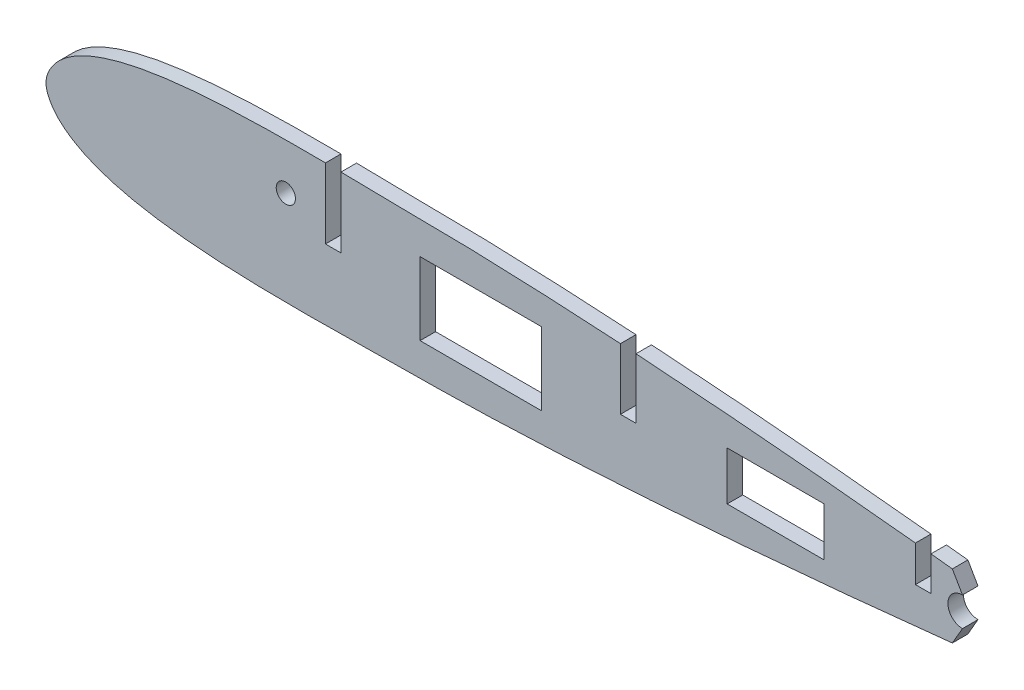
ISO-10303-21;
HEADER;
FILE_DESCRIPTION(('STEP AP214'),'2;1');
FILE_NAME('part.step','',(''),(''),'','','');
FILE_SCHEMA(('AUTOMOTIVE_DESIGN { 1 0 10303 214 1 1 1 1 }'));
ENDSEC;
DATA;
#1=APPLICATION_CONTEXT('core data for automotive mechanical design processes');
#2=APPLICATION_PROTOCOL_DEFINITION('international standard','automotive_design',2000,#1);
#3=PRODUCT_CONTEXT('',#1,'mechanical');
#4=PRODUCT('Part','Part','',(#3));
#5=PRODUCT_RELATED_PRODUCT_CATEGORY('part','',(#4));
#6=PRODUCT_DEFINITION_FORMATION('','',#4);
#7=PRODUCT_DEFINITION_CONTEXT('part definition',#1,'design');
#8=PRODUCT_DEFINITION('design','',#6,#7);
#9=PRODUCT_DEFINITION_SHAPE('','',#8);
#10=(LENGTH_UNIT() NAMED_UNIT(*) SI_UNIT(.MILLI.,.METRE.));
#11=(NAMED_UNIT(*) PLANE_ANGLE_UNIT() SI_UNIT($,.RADIAN.));
#12=(NAMED_UNIT(*) SI_UNIT($,.STERADIAN.) SOLID_ANGLE_UNIT());
#13=UNCERTAINTY_MEASURE_WITH_UNIT(LENGTH_MEASURE(1.E-05),#10,'distance_accuracy_value','');
#14=(GEOMETRIC_REPRESENTATION_CONTEXT(3) GLOBAL_UNCERTAINTY_ASSIGNED_CONTEXT((#13)) GLOBAL_UNIT_ASSIGNED_CONTEXT((#10,
#11,#12)) REPRESENTATION_CONTEXT('',''));
#15=CARTESIAN_POINT('',(0.,0.,0.));
#16=DIRECTION('',(0.,0.,1.));
#17=DIRECTION('',(1.,0.,0.));
#18=AXIS2_PLACEMENT_3D('',#15,#16,#17);
#19=CARTESIAN_POINT('',(73.1109777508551,2.76717396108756,-3.2));
#20=DIRECTION('',(0.,0.,-1.));
#21=DIRECTION('',(1.,0.,0.));
#22=AXIS2_PLACEMENT_3D('',#19,#20,#21);
#23=PLANE('',#22);
#24=DIRECTION('',(1.,0.,0.));
#25=VECTOR('',#24,1.);
#26=CARTESIAN_POINT('',(-60.9374477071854,-8.53281098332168,-3.2));
#27=LINE('',#26,#25);
#28=CARTESIAN_POINT('',(-60.9374477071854,-8.53281098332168,-3.2));
#29=VERTEX_POINT('',#28);
#30=CARTESIAN_POINT('',(-35.9374477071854,-8.53281098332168,-3.2));
#31=VERTEX_POINT('',#30);
#32=EDGE_CURVE('E310',#29,#31,#27,.T.);
#33=ORIENTED_EDGE('',*,*,#32,.T.);
#34=DIRECTION('',(0.,1.,0.));
#35=VECTOR('',#34,1.);
#36=CARTESIAN_POINT('',(-35.9374477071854,6.46718901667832,-3.2));
#37=LINE('',#36,#35);
#38=CARTESIAN_POINT('',(-35.9374477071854,6.46718901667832,-3.2));
#39=VERTEX_POINT('',#38);
#40=EDGE_CURVE('E315',#31,#39,#37,.T.);
#41=ORIENTED_EDGE('',*,*,#40,.T.);
#42=DIRECTION('',(-1.,0.,0.));
#43=VECTOR('',#42,1.);
#44=CARTESIAN_POINT('',(-60.9374477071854,6.46718901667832,-3.2));
#45=LINE('',#44,#43);
#46=CARTESIAN_POINT('',(-60.9374477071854,6.46718901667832,-3.2));
#47=VERTEX_POINT('',#46);
#48=EDGE_CURVE('E319',#39,#47,#45,.T.);
#49=ORIENTED_EDGE('',*,*,#48,.T.);
#50=DIRECTION('',(0.,-1.,0.));
#51=VECTOR('',#50,1.);
#52=CARTESIAN_POINT('',(-60.9374477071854,6.46718901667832,-3.2));
#53=LINE('',#52,#51);
#54=EDGE_CURVE('E306',#47,#29,#53,.T.);
#55=ORIENTED_EDGE('',*,*,#54,.T.);
#56=EDGE_LOOP('',(#33,#41,#49,#55));
#57=FACE_BOUND('',#56,.T.);
#58=DIRECTION('',(1.,0.,0.));
#59=VECTOR('',#58,1.);
#60=CARTESIAN_POINT('',(2.36255229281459,-6.03281098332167,-3.2));
#61=LINE('',#60,#59);
#62=CARTESIAN_POINT('',(2.36255229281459,-6.03281098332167,-3.2));
#63=VERTEX_POINT('',#62);
#64=CARTESIAN_POINT('',(22.3625522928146,-6.03281098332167,-3.2));
#65=VERTEX_POINT('',#64);
#66=EDGE_CURVE('E265',#63,#65,#61,.T.);
#67=ORIENTED_EDGE('',*,*,#66,.T.);
#68=DIRECTION('',(0.,1.,0.));
#69=VECTOR('',#68,1.);
#70=CARTESIAN_POINT('',(22.3625522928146,-6.03281098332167,-3.2));
#71=LINE('',#70,#69);
#72=CARTESIAN_POINT('',(22.3625522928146,3.96718901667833,-3.2));
#73=VERTEX_POINT('',#72);
#74=EDGE_CURVE('E270',#65,#73,#71,.T.);
#75=ORIENTED_EDGE('',*,*,#74,.T.);
#76=DIRECTION('',(-1.,0.,0.));
#77=VECTOR('',#76,1.);
#78=CARTESIAN_POINT('',(2.36255229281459,3.96718901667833,-3.2));
#79=LINE('',#78,#77);
#80=CARTESIAN_POINT('',(2.36255229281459,3.96718901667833,-3.2));
#81=VERTEX_POINT('',#80);
#82=EDGE_CURVE('E274',#73,#81,#79,.T.);
#83=ORIENTED_EDGE('',*,*,#82,.T.);
#84=DIRECTION('',(0.,-1.,0.));
#85=VECTOR('',#84,1.);
#86=CARTESIAN_POINT('',(2.36255229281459,-6.03281098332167,-3.2));
#87=LINE('',#86,#85);
#88=EDGE_CURVE('E261',#81,#63,#87,.T.);
#89=ORIENTED_EDGE('',*,*,#88,.T.);
#90=EDGE_LOOP('',(#67,#75,#83,#89));
#91=FACE_BOUND('',#90,.T.);
#92=CARTESIAN_POINT('',(50.8625522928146,-1.03281098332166,-3.2));
#93=DIRECTION('',(0.,0.,1.));
#94=DIRECTION('',(1.,0.,0.));
#95=AXIS2_PLACEMENT_3D('',#92,#93,#94);
#96=CIRCLE('',#95,3.);
#97=CARTESIAN_POINT('',(50.8625522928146,-4.03281098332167,-3.2));
#98=VERTEX_POINT('',#97);
#99=CARTESIAN_POINT('',(50.8625522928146,1.96718901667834,-3.2));
#100=VERTEX_POINT('',#99);
#101=EDGE_CURVE('E240',#98,#100,#96,.F.);
#102=ORIENTED_EDGE('',*,*,#101,.F.);
#103=DIRECTION('',(-0.499999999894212,-0.866025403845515,0.));
#104=VECTOR('',#103,1.);
#105=CARTESIAN_POINT('',(59.3691385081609,10.7010285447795,-3.2));
#106=LINE('',#105,#104);
#107=CARTESIAN_POINT('',(48.7727036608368,-7.65253499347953,-3.2017127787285));
#108=VERTEX_POINT('',#107);
#109=EDGE_CURVE('E213',#98,#108,#106,.T.);
#110=ORIENTED_EDGE('',*,*,#109,.T.);
#111=CARTESIAN_POINT('',(-80.4374477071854,13.4443350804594,-3.2));
#112=CARTESIAN_POINT('',(-81.8006706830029,13.4554971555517,-3.2));
#113=CARTESIAN_POINT('',(-85.1458243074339,13.4734032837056,-3.2));
#114=CARTESIAN_POINT('',(-90.4734834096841,13.4495670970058,-3.2));
#115=CARTESIAN_POINT('',(-96.4205625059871,13.3258606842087,-3.2));
#116=CARTESIAN_POINT('',(-102.369294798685,13.0744103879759,-3.2));
#117=CARTESIAN_POINT('',(-108.320662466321,12.6450852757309,-3.2));
#118=CARTESIAN_POINT('',(-113.878040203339,12.026122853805,-3.2));
#119=CARTESIAN_POINT('',(-119.041165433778,11.1792430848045,-3.2));
#120=CARTESIAN_POINT('',(-123.008119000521,10.276240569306,-3.2));
#121=CARTESIAN_POINT('',(-126.169709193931,9.32018202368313,-3.2));
#122=CARTESIAN_POINT('',(-128.562640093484,8.44544898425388,-3.2));
#123=CARTESIAN_POINT('',(-130.96962167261,7.3486093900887,-3.2));
#124=CARTESIAN_POINT('',(-133.419212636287,5.91146885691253,-3.2));
#125=CARTESIAN_POINT('',(-135.451185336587,4.23077972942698,-3.2));
#126=CARTESIAN_POINT('',(-137.240728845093,1.98115305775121,-3.2));
#127=CARTESIAN_POINT('',(-138.557845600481,-1.04571684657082,-3.2));
#128=CARTESIAN_POINT('',(-137.240403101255,-4.07244498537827,-3.2));
#129=CARTESIAN_POINT('',(-135.450617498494,-6.3218790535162,-3.2));
#130=CARTESIAN_POINT('',(-133.41846393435,-8.00234949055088,-3.2));
#131=CARTESIAN_POINT('',(-130.968718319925,-9.43922639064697,-3.2));
#132=CARTESIAN_POINT('',(-128.56161871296,-10.5358069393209,-3.2));
#133=CARTESIAN_POINT('',(-126.168593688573,-11.4102824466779,-3.2));
#134=CARTESIAN_POINT('',(-123.006900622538,-12.366000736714,-3.2));
#135=CARTESIAN_POINT('',(-119.039849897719,-13.2685763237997,-3.2));
#136=CARTESIAN_POINT('',(-113.876633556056,-14.1149004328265,-3.2));
#137=CARTESIAN_POINT('',(-108.319189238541,-14.7332647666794,-3.2));
#138=CARTESIAN_POINT('',(-102.36777540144,-15.161949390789,-3.2));
#139=CARTESIAN_POINT('',(-96.4190160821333,-15.4127594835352,-3.2));
#140=CARTESIAN_POINT('',(-90.4719237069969,-15.5358258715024,-3.2));
#141=CARTESIAN_POINT('',(-84.5255792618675,-15.5617901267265,-3.2));
#142=CARTESIAN_POINT('',(-78.5797220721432,-15.518516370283,-3.2));
#143=CARTESIAN_POINT('',(-72.7132535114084,-15.4365106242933,-3.2));
#144=CARTESIAN_POINT('',(-64.8661756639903,-15.2533469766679,-3.2));
#145=CARTESIAN_POINT('',(-55.0326455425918,-15.2595190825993,-3.2));
#146=CARTESIAN_POINT('',(-43.1405398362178,-14.8754543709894,-3.2));
#147=CARTESIAN_POINT('',(-31.1689328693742,-14.3558874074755,-3.2));
#148=CARTESIAN_POINT('',(-19.1986067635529,-13.6543817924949,-3.2));
#149=CARTESIAN_POINT('',(-7.22792859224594,-12.8347407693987,-3.2));
#150=CARTESIAN_POINT('',(4.66318857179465,-11.9053327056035,-3.2));
#151=CARTESIAN_POINT('',(16.5547312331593,-10.8822738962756,-3.2));
#152=CARTESIAN_POINT('',(28.4458294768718,-9.76389533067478,-3.2));
#153=CARTESIAN_POINT('',(39.1855199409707,-8.68024311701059,-3.2));
#154=CARTESIAN_POINT('',(45.9601822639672,-7.95856970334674,-3.2));
#155=CARTESIAN_POINT('',(48.7726808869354,-7.65250874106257,-3.2));
#156=B_SPLINE_CURVE_WITH_KNOTS('',3,(#111,#112,#113,#114,#115,#116,#117,#118,#119,#120,#121,
#122,#123,#124,#125,#126,#127,#128,#129,#130,#131,#132,#133,#134,#135,#136,#137,#138,#139,#140,
#141,#142,#143,#144,#145,#146,#147,#148,#149,#150,#151,#152,#153,#154,#155),.UNSPECIFIED.,.F.,
.F.,(4,1,1,1,1,1,1,1,1,1,1,1,1,1,1,1,1,1,1,1,1,1,1,1,1,1,1,1,1,1,1,1,1,1,1,1,1,1,1,1,1,1,4),
(0.371375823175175,0.379770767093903,0.391975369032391,0.404182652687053,0.416398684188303,
0.428636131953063,0.440920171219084,0.450818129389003,0.460843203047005,0.465945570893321,
0.471149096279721,0.476522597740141,0.482208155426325,0.488618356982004,0.492567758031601,0.5,
0.507432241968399,0.511381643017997,0.517791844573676,0.523477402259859,0.528850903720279,
0.534054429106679,0.539156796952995,0.549181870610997,0.559079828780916,0.571363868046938,
0.583601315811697,0.595817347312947,0.608024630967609,0.620229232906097,0.632433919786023,
0.644639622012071,0.656358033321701,0.680768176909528,0.70518703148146,0.729619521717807,
0.754557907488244,0.779023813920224,0.803506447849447,0.828005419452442,0.852521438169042,
0.87705400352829,0.89447551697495),.UNSPECIFIED.);
#157=CARTESIAN_POINT('',(-80.4374477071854,13.4443350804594,-3.2));
#158=VERTEX_POINT('',#157);
#159=EDGE_CURVE('E225',#158,#108,#156,.T.);
#160=ORIENTED_EDGE('',*,*,#159,.F.);
#161=DIRECTION('',(0.,1.,0.));
#162=VECTOR('',#161,1.);
#163=CARTESIAN_POINT('',(-80.4374477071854,-1.03281098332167,-3.2));
#164=LINE('',#163,#162);
#165=CARTESIAN_POINT('',(-80.4374477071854,-1.03281098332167,-3.2));
#166=VERTEX_POINT('',#165);
#167=EDGE_CURVE('E234',#166,#158,#164,.T.);
#168=ORIENTED_EDGE('',*,*,#167,.F.);
#169=DIRECTION('',(-1.,0.,0.));
#170=VECTOR('',#169,1.);
#171=CARTESIAN_POINT('',(-80.4374477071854,-1.03281098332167,-3.2));
#172=LINE('',#171,#170);
#173=CARTESIAN_POINT('',(-77.2374477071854,-1.03281098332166,-3.2));
#174=VERTEX_POINT('',#173);
#175=EDGE_CURVE('E564',#174,#166,#172,.T.);
#176=ORIENTED_EDGE('',*,*,#175,.F.);
#177=DIRECTION('',(0.,-1.,0.));
#178=VECTOR('',#177,1.);
#179=CARTESIAN_POINT('',(-77.2374477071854,-1.03281098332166,-3.2));
#180=LINE('',#179,#178);
#181=CARTESIAN_POINT('',(-77.2374477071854,13.4117089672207,-3.2));
#182=VERTEX_POINT('',#181);
#183=EDGE_CURVE('E600',#182,#174,#180,.T.);
#184=ORIENTED_EDGE('',*,*,#183,.F.);
#185=CARTESIAN_POINT('',(-19.6374477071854,11.5837049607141,-3.2));
#186=CARTESIAN_POINT('',(-23.5083202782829,11.827758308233,-3.2));
#187=CARTESIAN_POINT('',(-31.3414661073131,12.2834181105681,-3.2));
#188=CARTESIAN_POINT('',(-43.1420287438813,12.7942893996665,-3.2));
#189=CARTESIAN_POINT('',(-55.0341757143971,13.1770742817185,-3.2));
#190=CARTESIAN_POINT('',(-64.8677051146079,13.1698438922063,-3.2));
#191=CARTESIAN_POINT('',(-72.2668637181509,13.3417556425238,-3.2));
#192=CARTESIAN_POINT('',(-75.703508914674,13.3931359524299,-3.2));
#193=CARTESIAN_POINT('',(-77.2374477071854,13.4117089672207,-3.2));
#194=B_SPLINE_CURVE_WITH_KNOTS('',3,(#185,#186,#187,#188,#189,#190,#191,#192,#193),
.UNSPECIFIED.,.F.,.F.,(4,1,1,1,1,1,4),(0.246496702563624,0.270380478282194,0.29481296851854,
0.319231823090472,0.343641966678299,0.355360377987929,0.364806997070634),.UNSPECIFIED.);
#195=CARTESIAN_POINT('',(-19.6374477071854,11.5837049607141,-3.2));
#196=VERTEX_POINT('',#195);
#197=EDGE_CURVE('E607',#196,#182,#194,.T.);
#198=ORIENTED_EDGE('',*,*,#197,.F.);
#199=DIRECTION('',(0.,1.,0.));
#200=VECTOR('',#199,1.);
#201=CARTESIAN_POINT('',(-19.6374477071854,-1.03281098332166,-3.2));
#202=LINE('',#201,#200);
#203=CARTESIAN_POINT('',(-19.6374477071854,-1.03281098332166,-3.2));
#204=VERTEX_POINT('',#203);
#205=EDGE_CURVE('E614',#204,#196,#202,.T.);
#206=ORIENTED_EDGE('',*,*,#205,.F.);
#207=DIRECTION('',(-1.,0.,0.));
#208=VECTOR('',#207,1.);
#209=CARTESIAN_POINT('',(-19.6374477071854,-1.03281098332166,-3.2));
#210=LINE('',#209,#208);
#211=CARTESIAN_POINT('',(-16.4374477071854,-1.03281098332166,-3.2));
#212=VERTEX_POINT('',#211);
#213=EDGE_CURVE('E651',#212,#204,#210,.T.);
#214=ORIENTED_EDGE('',*,*,#213,.F.);
#215=DIRECTION('',(0.,-1.,0.));
#216=VECTOR('',#215,1.);
#217=CARTESIAN_POINT('',(-16.4374477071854,-1.03281098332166,-3.2));
#218=LINE('',#217,#216);
#219=CARTESIAN_POINT('',(-16.4374477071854,11.3777301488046,-3.2));
#220=VERTEX_POINT('',#219);
#221=EDGE_CURVE('E372',#220,#212,#218,.T.);
#222=ORIENTED_EDGE('',*,*,#221,.F.);
#223=CARTESIAN_POINT('',(41.1625522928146,6.39263718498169,-3.2));
#224=CARTESIAN_POINT('',(40.8858120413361,6.42156748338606,-3.2));
#225=CARTESIAN_POINT('',(36.6466893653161,6.86375130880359,-3.2));
#226=CARTESIAN_POINT('',(28.444890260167,7.69043450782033,-3.2));
#227=CARTESIAN_POINT('',(16.5536717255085,8.8075333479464,-3.2));
#228=CARTESIAN_POINT('',(4.66201903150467,9.82931238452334,-3.2));
#229=CARTESIAN_POINT('',(-6.33430215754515,10.6875926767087,-3.2));
#230=CARTESIAN_POINT('',(-13.3686011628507,11.1761671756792,-3.2));
#231=CARTESIAN_POINT('',(-16.4374477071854,11.3777301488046,-3.2));
#232=B_SPLINE_CURVE_WITH_KNOTS('',3,(#223,#224,#225,#226,#227,#228,#229,#230,#231),
.UNSPECIFIED.,.F.,.F.,(4,1,1,1,1,1,4),(0.121232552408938,0.12294599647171,0.147478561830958,
0.171994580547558,0.196493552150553,0.220976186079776,0.239914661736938),.UNSPECIFIED.);
#233=CARTESIAN_POINT('',(41.1625522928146,6.39263718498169,-3.2));
#234=VERTEX_POINT('',#233);
#235=EDGE_CURVE('E365',#234,#220,#232,.T.);
#236=ORIENTED_EDGE('',*,*,#235,.F.);
#237=DIRECTION('',(0.,1.,0.));
#238=VECTOR('',#237,1.);
#239=CARTESIAN_POINT('',(41.1625522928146,-1.03281098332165,-3.2));
#240=LINE('',#239,#238);
#241=CARTESIAN_POINT('',(41.1625522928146,-1.03281098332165,-3.2));
#242=VERTEX_POINT('',#241);
#243=EDGE_CURVE('E360',#242,#234,#240,.T.);
#244=ORIENTED_EDGE('',*,*,#243,.F.);
#245=DIRECTION('',(-1.,0.,0.));
#246=VECTOR('',#245,1.);
#247=CARTESIAN_POINT('',(41.1625522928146,-1.03281098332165,-3.2));
#248=LINE('',#247,#246);
#249=CARTESIAN_POINT('',(44.3625522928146,-1.03281098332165,-3.2));
#250=VERTEX_POINT('',#249);
#251=EDGE_CURVE('E353',#250,#242,#248,.T.);
#252=ORIENTED_EDGE('',*,*,#251,.F.);
#253=DIRECTION('',(0.,-1.,0.));
#254=VECTOR('',#253,1.);
#255=CARTESIAN_POINT('',(44.3625522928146,-1.03281098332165,-3.2));
#256=LINE('',#255,#254);
#257=CARTESIAN_POINT('',(44.3625522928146,6.05528791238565,-3.2));
#258=VERTEX_POINT('',#257);
#259=EDGE_CURVE('E361',#258,#250,#256,.T.);
#260=ORIENTED_EDGE('',*,*,#259,.F.);
#261=CARTESIAN_POINT('',(48.7762257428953,5.58077271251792,-3.2));
#262=CARTESIAN_POINT('',(47.3051899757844,5.74069659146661,-3.2));
#263=CARTESIAN_POINT('',(45.8339647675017,5.89887388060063,-3.2));
#264=CARTESIAN_POINT('',(44.3625522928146,6.05528791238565,-3.2));
#265=B_SPLINE_CURVE_WITH_KNOTS('',3,(#261,#262,#263,#264),.UNSPECIFIED.,.F.,.F.,(4,4),
(0.105515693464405,0.114627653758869),.UNSPECIFIED.);
#266=CARTESIAN_POINT('',(48.7762275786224,5.58080940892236,-3.2));
#267=VERTEX_POINT('',#266);
#268=EDGE_CURVE('E436',#267,#258,#265,.T.);
#269=ORIENTED_EDGE('',*,*,#268,.F.);
#270=DIRECTION('',(-0.500000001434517,0.86602540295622,0.));
#271=VECTOR('',#270,1.);
#272=CARTESIAN_POINT('',(56.0782550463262,-7.06667311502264,-3.2));
#273=LINE('',#272,#271);
#274=EDGE_CURVE('E248',#100,#267,#273,.T.);
#275=ORIENTED_EDGE('',*,*,#274,.F.);
#276=EDGE_LOOP('',(#102,#110,#160,#168,#176,#184,#198,#206,#214,#222,#236,#244,#252,#260,#269,#275));
#277=FACE_BOUND('',#276,.T.);
#278=CARTESIAN_POINT('',(-88.6046583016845,3.96718901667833,-3.2));
#279=DIRECTION('',(0.,0.,-1.));
#280=DIRECTION('',(-1.,0.,0.));
#281=AXIS2_PLACEMENT_3D('',#278,#279,#280);
#282=CIRCLE('',#281,1.9812);
#283=CARTESIAN_POINT('',(-90.5858583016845,3.96718901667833,-3.2));
#284=VERTEX_POINT('',#283);
#285=EDGE_CURVE('E222',#284,#284,#282,.F.);
#286=ORIENTED_EDGE('',*,*,#285,.T.);
#287=EDGE_LOOP('',(#286));
#288=FACE_BOUND('',#287,.T.);
#289=ADVANCED_FACE('F49',(#57,#91,#277,#288),#23,.T.);
#290=CARTESIAN_POINT('',(73.1109777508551,2.76717396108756,0.));
#291=DIRECTION('',(0.,0.,-1.));
#292=DIRECTION('',(1.,0.,0.));
#293=AXIS2_PLACEMENT_3D('',#290,#291,#292);
#294=PLANE('',#293);
#295=DIRECTION('',(0.,-1.,0.));
#296=VECTOR('',#295,1.);
#297=CARTESIAN_POINT('',(2.36255229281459,-6.03281098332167,0.));
#298=LINE('',#297,#296);
#299=CARTESIAN_POINT('',(2.3625522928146,3.96718901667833,0.));
#300=VERTEX_POINT('',#299);
#301=CARTESIAN_POINT('',(2.36255229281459,-6.03281098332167,0.));
#302=VERTEX_POINT('',#301);
#303=EDGE_CURVE('E279',#300,#302,#298,.T.);
#304=ORIENTED_EDGE('',*,*,#303,.F.);
#305=DIRECTION('',(-1.,0.,0.));
#306=VECTOR('',#305,1.);
#307=CARTESIAN_POINT('',(2.36255229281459,3.96718901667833,0.));
#308=LINE('',#307,#306);
#309=CARTESIAN_POINT('',(22.3625522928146,3.96718901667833,0.));
#310=VERTEX_POINT('',#309);
#311=EDGE_CURVE('E266',#310,#300,#308,.T.);
#312=ORIENTED_EDGE('',*,*,#311,.F.);
#313=DIRECTION('',(0.,1.,0.));
#314=VECTOR('',#313,1.);
#315=CARTESIAN_POINT('',(22.3625522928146,-6.03281098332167,0.));
#316=LINE('',#315,#314);
#317=CARTESIAN_POINT('',(22.3625522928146,-6.03281098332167,0.));
#318=VERTEX_POINT('',#317);
#319=EDGE_CURVE('E287',#318,#310,#316,.T.);
#320=ORIENTED_EDGE('',*,*,#319,.F.);
#321=DIRECTION('',(1.,0.,0.));
#322=VECTOR('',#321,1.);
#323=CARTESIAN_POINT('',(2.36255229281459,-6.03281098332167,0.));
#324=LINE('',#323,#322);
#325=EDGE_CURVE('E283',#302,#318,#324,.T.);
#326=ORIENTED_EDGE('',*,*,#325,.F.);
#327=EDGE_LOOP('',(#304,#312,#320,#326));
#328=FACE_BOUND('',#327,.T.);
#329=DIRECTION('',(0.,-1.,0.));
#330=VECTOR('',#329,1.);
#331=CARTESIAN_POINT('',(-60.9374477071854,6.46718901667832,0.));
#332=LINE('',#331,#330);
#333=CARTESIAN_POINT('',(-60.9374477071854,6.46718901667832,0.));
#334=VERTEX_POINT('',#333);
#335=CARTESIAN_POINT('',(-60.9374477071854,-8.53281098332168,0.));
#336=VERTEX_POINT('',#335);
#337=EDGE_CURVE('E305',#334,#336,#332,.T.);
#338=ORIENTED_EDGE('',*,*,#337,.F.);
#339=DIRECTION('',(-1.,0.,0.));
#340=VECTOR('',#339,1.);
#341=CARTESIAN_POINT('',(-60.9374477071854,6.46718901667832,0.));
#342=LINE('',#341,#340);
#343=CARTESIAN_POINT('',(-35.9374477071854,6.46718901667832,0.));
#344=VERTEX_POINT('',#343);
#345=EDGE_CURVE('E311',#344,#334,#342,.T.);
#346=ORIENTED_EDGE('',*,*,#345,.F.);
#347=DIRECTION('',(0.,1.,0.));
#348=VECTOR('',#347,1.);
#349=CARTESIAN_POINT('',(-35.9374477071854,6.46718901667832,0.));
#350=LINE('',#349,#348);
#351=CARTESIAN_POINT('',(-35.9374477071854,-8.53281098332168,0.));
#352=VERTEX_POINT('',#351);
#353=EDGE_CURVE('E331',#352,#344,#350,.T.);
#354=ORIENTED_EDGE('',*,*,#353,.F.);
#355=DIRECTION('',(1.,0.,0.));
#356=VECTOR('',#355,1.);
#357=CARTESIAN_POINT('',(-60.9374477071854,-8.53281098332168,0.));
#358=LINE('',#357,#356);
#359=EDGE_CURVE('E327',#336,#352,#358,.T.);
#360=ORIENTED_EDGE('',*,*,#359,.F.);
#361=EDGE_LOOP('',(#338,#346,#354,#360));
#362=FACE_BOUND('',#361,.T.);
#363=DIRECTION('',(-0.500000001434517,0.86602540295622,0.));
#364=VECTOR('',#363,1.);
#365=CARTESIAN_POINT('',(56.0782550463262,-7.06667311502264,0.));
#366=LINE('',#365,#364);
#367=CARTESIAN_POINT('',(50.8625522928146,1.96718901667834,0.));
#368=VERTEX_POINT('',#367);
#369=CARTESIAN_POINT('',(48.7762503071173,5.5807700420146,0.));
#370=VERTEX_POINT('',#369);
#371=EDGE_CURVE('E903',#368,#370,#366,.T.);
#372=ORIENTED_EDGE('',*,*,#371,.T.);
#373=CARTESIAN_POINT('',(101.799188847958,-1.01023941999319,0.));
#374=CARTESIAN_POINT('',(97.1662744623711,-0.37213420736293,0.));
#375=CARTESIAN_POINT('',(88.5756524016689,0.81992622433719,0.));
#376=CARTESIAN_POINT('',(76.0115979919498,2.42157660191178,0.));
#377=CARTESIAN_POINT('',(64.120042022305,3.86166442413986,0.));
#378=CARTESIAN_POINT('',(53.5701477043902,5.06228088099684,0.));
#379=CARTESIAN_POINT('',(46.9835418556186,5.77667158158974,0.));
#380=CARTESIAN_POINT('',(44.3625522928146,6.05528791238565,0.));
#381=B_SPLINE_CURVE_WITH_KNOTS('',3,(#373,#374,#375,#376,#377,#378,#379,#380),.UNSPECIFIED.,.F.,
.F.,(4,1,1,1,1,4),(-0.00416433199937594,0.0246342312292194,0.0492428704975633,
0.0738297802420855,0.0983967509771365,0.114627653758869),.UNSPECIFIED.);
#382=CARTESIAN_POINT('',(44.3625522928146,6.05528791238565,0.));
#383=VERTEX_POINT('',#382);
#384=EDGE_CURVE('E348',#370,#383,#381,.T.);
#385=ORIENTED_EDGE('',*,*,#384,.T.);
#386=DIRECTION('',(0.,-1.,0.));
#387=VECTOR('',#386,1.);
#388=CARTESIAN_POINT('',(44.3625522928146,-1.03281098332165,0.));
#389=LINE('',#388,#387);
#390=CARTESIAN_POINT('',(44.3625522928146,-1.03281098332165,0.));
#391=VERTEX_POINT('',#390);
#392=EDGE_CURVE('E550',#383,#391,#389,.T.);
#393=ORIENTED_EDGE('',*,*,#392,.T.);
#394=DIRECTION('',(-1.,0.,0.));
#395=VECTOR('',#394,1.);
#396=CARTESIAN_POINT('',(41.1625522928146,-1.03281098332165,0.));
#397=LINE('',#396,#395);
#398=CARTESIAN_POINT('',(41.1625522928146,-1.03281098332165,0.));
#399=VERTEX_POINT('',#398);
#400=EDGE_CURVE('E480',#391,#399,#397,.T.);
#401=ORIENTED_EDGE('',*,*,#400,.T.);
#402=DIRECTION('',(0.,1.,0.));
#403=VECTOR('',#402,1.);
#404=CARTESIAN_POINT('',(41.1625522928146,6.05528791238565,0.));
#405=LINE('',#404,#403);
#406=CARTESIAN_POINT('',(41.1625522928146,6.39263718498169,0.));
#407=VERTEX_POINT('',#406);
#408=EDGE_CURVE('E541',#399,#407,#405,.T.);
#409=ORIENTED_EDGE('',*,*,#408,.T.);
#410=CARTESIAN_POINT('',(41.1625522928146,6.39263718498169,0.));
#411=CARTESIAN_POINT('',(40.8858120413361,6.42156748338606,0.));
#412=CARTESIAN_POINT('',(36.6466893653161,6.86375130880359,0.));
#413=CARTESIAN_POINT('',(28.444890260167,7.69043450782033,0.));
#414=CARTESIAN_POINT('',(16.5536717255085,8.8075333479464,0.));
#415=CARTESIAN_POINT('',(4.66201903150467,9.82931238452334,0.));
#416=CARTESIAN_POINT('',(-6.33430215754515,10.6875926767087,0.));
#417=CARTESIAN_POINT('',(-13.3686011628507,11.1761671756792,0.));
#418=CARTESIAN_POINT('',(-16.4374477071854,11.3777301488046,0.));
#419=B_SPLINE_CURVE_WITH_KNOTS('',3,(#410,#411,#412,#413,#414,#415,#416,#417,#418),
.UNSPECIFIED.,.F.,.F.,(4,1,1,1,1,1,4),(0.121232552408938,0.12294599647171,0.147478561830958,
0.171994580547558,0.196493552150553,0.220976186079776,0.239914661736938),.UNSPECIFIED.);
#420=CARTESIAN_POINT('',(-16.4374477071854,11.3777301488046,0.));
#421=VERTEX_POINT('',#420);
#422=EDGE_CURVE('E535',#407,#421,#419,.T.);
#423=ORIENTED_EDGE('',*,*,#422,.T.);
#424=DIRECTION('',(0.,-1.,0.));
#425=VECTOR('',#424,1.);
#426=CARTESIAN_POINT('',(-16.4374477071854,-1.03281098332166,0.));
#427=LINE('',#426,#425);
#428=CARTESIAN_POINT('',(-16.4374477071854,-1.03281098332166,0.));
#429=VERTEX_POINT('',#428);
#430=EDGE_CURVE('E531',#421,#429,#427,.T.);
#431=ORIENTED_EDGE('',*,*,#430,.T.);
#432=DIRECTION('',(-1.,0.,0.));
#433=VECTOR('',#432,1.);
#434=CARTESIAN_POINT('',(-19.6374477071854,-1.03281098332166,0.));
#435=LINE('',#434,#433);
#436=CARTESIAN_POINT('',(-19.6374477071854,-1.03281098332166,0.));
#437=VERTEX_POINT('',#436);
#438=EDGE_CURVE('E527',#429,#437,#435,.T.);
#439=ORIENTED_EDGE('',*,*,#438,.T.);
#440=DIRECTION('',(0.,1.,0.));
#441=VECTOR('',#440,1.);
#442=CARTESIAN_POINT('',(-19.6374477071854,11.3777301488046,0.));
#443=LINE('',#442,#441);
#444=CARTESIAN_POINT('',(-19.6374477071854,11.5837049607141,0.));
#445=VERTEX_POINT('',#444);
#446=EDGE_CURVE('E520',#437,#445,#443,.T.);
#447=ORIENTED_EDGE('',*,*,#446,.T.);
#448=CARTESIAN_POINT('',(-19.6374477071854,11.5837049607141,0.));
#449=CARTESIAN_POINT('',(-23.5083202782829,11.827758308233,0.));
#450=CARTESIAN_POINT('',(-31.3414661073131,12.2834181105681,0.));
#451=CARTESIAN_POINT('',(-43.1420287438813,12.7942893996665,0.));
#452=CARTESIAN_POINT('',(-55.0341757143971,13.1770742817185,0.));
#453=CARTESIAN_POINT('',(-64.8677051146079,13.1698438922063,0.));
#454=CARTESIAN_POINT('',(-72.2668637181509,13.3417556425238,0.));
#455=CARTESIAN_POINT('',(-75.703508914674,13.3931359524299,0.));
#456=CARTESIAN_POINT('',(-77.2374477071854,13.4117089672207,0.));
#457=B_SPLINE_CURVE_WITH_KNOTS('',3,(#448,#449,#450,#451,#452,#453,#454,#455,#456),
.UNSPECIFIED.,.F.,.F.,(4,1,1,1,1,1,4),(0.246496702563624,0.270380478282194,0.29481296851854,
0.319231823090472,0.343641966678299,0.355360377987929,0.364806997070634),.UNSPECIFIED.);
#458=CARTESIAN_POINT('',(-77.2374477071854,13.4117089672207,0.));
#459=VERTEX_POINT('',#458);
#460=EDGE_CURVE('E514',#445,#459,#457,.T.);
#461=ORIENTED_EDGE('',*,*,#460,.T.);
#462=DIRECTION('',(0.,-1.,0.));
#463=VECTOR('',#462,1.);
#464=CARTESIAN_POINT('',(-77.2374477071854,-1.03281098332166,0.));
#465=LINE('',#464,#463);
#466=CARTESIAN_POINT('',(-77.2374477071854,-1.03281098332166,0.));
#467=VERTEX_POINT('',#466);
#468=EDGE_CURVE('E466',#459,#467,#465,.T.);
#469=ORIENTED_EDGE('',*,*,#468,.T.);
#470=DIRECTION('',(-1.,0.,0.));
#471=VECTOR('',#470,1.);
#472=CARTESIAN_POINT('',(-80.4374477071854,-1.03281098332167,0.));
#473=LINE('',#472,#471);
#474=CARTESIAN_POINT('',(-80.4374477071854,-1.03281098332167,0.));
#475=VERTEX_POINT('',#474);
#476=EDGE_CURVE('E459',#467,#475,#473,.T.);
#477=ORIENTED_EDGE('',*,*,#476,.T.);
#478=DIRECTION('',(-8.50716584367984E-13,1.,0.));
#479=VECTOR('',#478,1.);
#480=CARTESIAN_POINT('',(-80.4374477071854,13.4117089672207,0.));
#481=LINE('',#480,#479);
#482=CARTESIAN_POINT('',(-80.4374477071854,13.4443350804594,0.));
#483=VERTEX_POINT('',#482);
#484=EDGE_CURVE('E452',#475,#483,#481,.T.);
#485=ORIENTED_EDGE('',*,*,#484,.T.);
#486=CARTESIAN_POINT('',(48.7727213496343,-7.65250433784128,0.));
#487=CARTESIAN_POINT('',(45.9602092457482,-7.95856682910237,0.));
#488=CARTESIAN_POINT('',(39.1855334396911,-8.68024175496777,0.));
#489=CARTESIAN_POINT('',(28.4458294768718,-9.76389533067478,0.));
#490=CARTESIAN_POINT('',(16.5547312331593,-10.8822738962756,0.));
#491=CARTESIAN_POINT('',(4.66318857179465,-11.9053327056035,0.));
#492=CARTESIAN_POINT('',(-7.22792859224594,-12.8347407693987,0.));
#493=CARTESIAN_POINT('',(-19.1986067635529,-13.6543817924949,0.));
#494=CARTESIAN_POINT('',(-31.1689328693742,-14.3558874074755,0.));
#495=CARTESIAN_POINT('',(-43.1405398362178,-14.8754543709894,0.));
#496=CARTESIAN_POINT('',(-55.0326455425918,-15.2595190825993,0.));
#497=CARTESIAN_POINT('',(-64.8661756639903,-15.2533469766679,0.));
#498=CARTESIAN_POINT('',(-72.7132535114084,-15.4365106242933,0.));
#499=CARTESIAN_POINT('',(-78.5797220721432,-15.518516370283,0.));
#500=CARTESIAN_POINT('',(-84.5255792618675,-15.5617901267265,0.));
#501=CARTESIAN_POINT('',(-90.4719237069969,-15.5358258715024,0.));
#502=CARTESIAN_POINT('',(-96.4190160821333,-15.4127594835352,0.));
#503=CARTESIAN_POINT('',(-102.36777540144,-15.161949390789,0.));
#504=CARTESIAN_POINT('',(-108.319189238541,-14.7332647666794,0.));
#505=CARTESIAN_POINT('',(-113.876633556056,-14.1149004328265,0.));
#506=CARTESIAN_POINT('',(-119.039849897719,-13.2685763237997,0.));
#507=CARTESIAN_POINT('',(-123.006900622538,-12.366000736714,0.));
#508=CARTESIAN_POINT('',(-126.168593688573,-11.4102824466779,0.));
#509=CARTESIAN_POINT('',(-128.56161871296,-10.5358069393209,0.));
#510=CARTESIAN_POINT('',(-130.968718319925,-9.43922639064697,0.));
#511=CARTESIAN_POINT('',(-133.41846393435,-8.00234949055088,0.));
#512=CARTESIAN_POINT('',(-135.450617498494,-6.3218790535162,0.));
#513=CARTESIAN_POINT('',(-137.240403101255,-4.07244498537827,0.));
#514=CARTESIAN_POINT('',(-138.557845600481,-1.04571684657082,0.));
#515=CARTESIAN_POINT('',(-137.240728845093,1.98115305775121,0.));
#516=CARTESIAN_POINT('',(-135.451185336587,4.23077972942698,0.));
#517=CARTESIAN_POINT('',(-133.419212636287,5.91146885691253,0.));
#518=CARTESIAN_POINT('',(-130.96962167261,7.3486093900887,0.));
#519=CARTESIAN_POINT('',(-128.562640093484,8.44544898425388,0.));
#520=CARTESIAN_POINT('',(-126.169709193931,9.32018202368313,0.));
#521=CARTESIAN_POINT('',(-123.008119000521,10.276240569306,0.));
#522=CARTESIAN_POINT('',(-119.041165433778,11.1792430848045,0.));
#523=CARTESIAN_POINT('',(-113.878040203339,12.026122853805,0.));
#524=CARTESIAN_POINT('',(-108.320662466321,12.6450852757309,0.));
#525=CARTESIAN_POINT('',(-102.369294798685,13.0744103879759,0.));
#526=CARTESIAN_POINT('',(-96.4205625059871,13.3258606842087,0.));
#527=CARTESIAN_POINT('',(-90.4734834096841,13.4495670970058,0.));
#528=CARTESIAN_POINT('',(-85.1458243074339,13.4734032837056,0.));
#529=CARTESIAN_POINT('',(-81.8006706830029,13.4554971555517,0.));
#530=CARTESIAN_POINT('',(-80.4374477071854,13.4443350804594,0.));
#531=B_SPLINE_CURVE_WITH_KNOTS('',3,(#486,#487,#488,#489,#490,#491,#492,#493,#494,#495,#496,
#497,#498,#499,#500,#501,#502,#503,#504,#505,#506,#507,#508,#509,#510,#511,#512,#513,#514,#515,
#516,#517,#518,#519,#520,#521,#522,#523,#524,#525,#526,#527,#528,#529,#530),.UNSPECIFIED.,.F.,
.F.,(4,1,1,1,1,1,1,1,1,1,1,1,1,1,1,1,1,1,1,1,1,1,1,1,1,1,1,1,1,1,1,1,1,1,1,1,1,1,1,1,1,1,4),
(0.371375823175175,0.388797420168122,0.413329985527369,0.43784600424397,0.462344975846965,
0.486827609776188,0.511293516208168,0.536231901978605,0.560664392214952,0.585083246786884,
0.609493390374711,0.62121180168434,0.633417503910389,0.645622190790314,0.657826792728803,
0.670034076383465,0.682250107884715,0.694487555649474,0.706771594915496,0.716669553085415,
0.726694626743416,0.731796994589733,0.737000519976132,0.742374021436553,0.748059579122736,
0.754469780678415,0.758419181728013,0.765851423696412,0.77328366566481,0.777233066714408,
0.783643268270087,0.78932882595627,0.794702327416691,0.799905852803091,0.805008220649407,
0.815033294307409,0.824931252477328,0.837215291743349,0.849452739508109,0.861668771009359,
0.873876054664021,0.886080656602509,0.894475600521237),.UNSPECIFIED.);
#532=CARTESIAN_POINT('',(48.7727214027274,-7.65250477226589,1.20769492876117E-05));
#533=VERTEX_POINT('',#532);
#534=EDGE_CURVE('E448',#483,#533,#531,.F.);
#535=ORIENTED_EDGE('',*,*,#534,.T.);
#536=DIRECTION('',(-0.499999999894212,-0.866025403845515,0.));
#537=VECTOR('',#536,1.);
#538=CARTESIAN_POINT('',(59.3691385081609,10.7010285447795,0.));
#539=LINE('',#538,#537);
#540=CARTESIAN_POINT('',(50.8625522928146,-4.03281098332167,0.));
#541=VERTEX_POINT('',#540);
#542=EDGE_CURVE('E216',#541,#533,#539,.T.);
#543=ORIENTED_EDGE('',*,*,#542,.F.);
#544=CARTESIAN_POINT('',(50.8625522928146,-1.03281098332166,0.));
#545=DIRECTION('',(0.,0.,-1.));
#546=DIRECTION('',(-1.,0.,0.));
#547=AXIS2_PLACEMENT_3D('',#544,#545,#546);
#548=CIRCLE('',#547,3.);
#549=EDGE_CURVE('E256',#541,#368,#548,.T.);
#550=ORIENTED_EDGE('',*,*,#549,.T.);
#551=EDGE_LOOP('',(#372,#385,#393,#401,#409,#423,#431,#439,#447,#461,#469,#477,#485,#535,#543,#550));
#552=FACE_BOUND('',#551,.T.);
#553=CARTESIAN_POINT('',(-88.6046583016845,3.96718901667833,0.));
#554=DIRECTION('',(0.,0.,1.));
#555=DIRECTION('',(1.,0.,0.));
#556=AXIS2_PLACEMENT_3D('',#553,#554,#555);
#557=CIRCLE('',#556,1.9812);
#558=CARTESIAN_POINT('',(-86.6234583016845,3.96718901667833,0.));
#559=VERTEX_POINT('',#558);
#560=EDGE_CURVE('E893',#559,#559,#557,.T.);
#561=ORIENTED_EDGE('',*,*,#560,.F.);
#562=EDGE_LOOP('',(#561));
#563=FACE_BOUND('',#562,.T.);
#564=ADVANCED_FACE('F398',(#328,#362,#552,#563),#294,.F.);
#565=CARTESIAN_POINT('',(101.799188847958,-1.01023941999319,-3.2));
#566=CARTESIAN_POINT('',(97.1662744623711,-0.37213420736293,-3.2));
#567=CARTESIAN_POINT('',(88.5756524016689,0.81992622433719,-3.2));
#568=CARTESIAN_POINT('',(76.0115979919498,2.42157660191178,-3.2));
#569=CARTESIAN_POINT('',(64.120042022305,3.86166442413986,-3.2));
#570=CARTESIAN_POINT('',(53.5701477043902,5.06228088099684,-3.2));
#571=CARTESIAN_POINT('',(46.9835418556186,5.77667158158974,-3.2));
#572=CARTESIAN_POINT('',(44.3625522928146,6.05528791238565,-3.2));
#573=B_SPLINE_CURVE_WITH_KNOTS('',3,(#565,#566,#567,#568,#569,#570,#571,#572),.UNSPECIFIED.,.F.,
.F.,(4,1,1,1,1,4),(-0.00416433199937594,0.0246342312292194,0.0492428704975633,
0.0738297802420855,0.0983967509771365,0.114627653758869),.UNSPECIFIED.);
#574=DIRECTION('',(0.,0.,1.));
#575=VECTOR('',#574,1.);
#576=SURFACE_OF_LINEAR_EXTRUSION('',#573,#575);
#577=DIRECTION('',(0.,0.,1.));
#578=VECTOR('',#577,1.);
#579=CARTESIAN_POINT('',(48.7762503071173,5.5807700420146,-3.2));
#580=LINE('',#579,#578);
#581=EDGE_CURVE('E221',#370,#267,#580,.F.);
#582=ORIENTED_EDGE('',*,*,#581,.T.);
#583=ORIENTED_EDGE('',*,*,#268,.T.);
#584=DIRECTION('',(0.,0.,1.));
#585=VECTOR('',#584,1.);
#586=CARTESIAN_POINT('',(44.3625522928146,6.05528791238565,-3.2));
#587=LINE('',#586,#585);
#588=EDGE_CURVE('E11',#258,#383,#587,.T.);
#589=ORIENTED_EDGE('',*,*,#588,.T.);
#590=ORIENTED_EDGE('',*,*,#384,.F.);
#591=EDGE_LOOP('',(#582,#583,#589,#590));
#592=FACE_BOUND('',#591,.T.);
#593=ADVANCED_FACE('F51',(#592),#576,.T.);
#594=CARTESIAN_POINT('',(44.3625522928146,-1.03281098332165,-3.2));
#595=DIRECTION('',(1.,0.,0.));
#596=DIRECTION('',(0.,1.,0.));
#597=AXIS2_PLACEMENT_3D('',#594,#595,#596);
#598=PLANE('',#597);
#599=ORIENTED_EDGE('',*,*,#392,.F.);
#600=ORIENTED_EDGE('',*,*,#588,.F.);
#601=ORIENTED_EDGE('',*,*,#259,.T.);
#602=DIRECTION('',(0.,0.,1.));
#603=VECTOR('',#602,1.);
#604=CARTESIAN_POINT('',(44.3625522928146,-1.03281098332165,-3.2));
#605=LINE('',#604,#603);
#606=EDGE_CURVE('E63',#250,#391,#605,.T.);
#607=ORIENTED_EDGE('',*,*,#606,.T.);
#608=EDGE_LOOP('',(#599,#600,#601,#607));
#609=FACE_BOUND('',#608,.T.);
#610=ADVANCED_FACE('F391',(#609),#598,.F.);
#611=CARTESIAN_POINT('',(41.1625522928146,-1.03281098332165,-3.2));
#612=DIRECTION('',(0.,-1.,0.));
#613=DIRECTION('',(0.,0.,1.));
#614=AXIS2_PLACEMENT_3D('',#611,#612,#613);
#615=PLANE('',#614);
#616=ORIENTED_EDGE('',*,*,#400,.F.);
#617=ORIENTED_EDGE('',*,*,#606,.F.);
#618=ORIENTED_EDGE('',*,*,#251,.T.);
#619=DIRECTION('',(0.,0.,1.));
#620=VECTOR('',#619,1.);
#621=CARTESIAN_POINT('',(41.1625522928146,-1.03281098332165,-3.2));
#622=LINE('',#621,#620);
#623=EDGE_CURVE('E477',#242,#399,#622,.T.);
#624=ORIENTED_EDGE('',*,*,#623,.T.);
#625=EDGE_LOOP('',(#616,#617,#618,#624));
#626=FACE_BOUND('',#625,.T.);
#627=ADVANCED_FACE('F388',(#626),#615,.F.);
#628=CARTESIAN_POINT('',(41.1625522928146,6.05528791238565,-3.2));
#629=DIRECTION('',(-1.,0.,0.));
#630=DIRECTION('',(0.,-1.,0.));
#631=AXIS2_PLACEMENT_3D('',#628,#629,#630);
#632=PLANE('',#631);
#633=ORIENTED_EDGE('',*,*,#408,.F.);
#634=ORIENTED_EDGE('',*,*,#623,.F.);
#635=ORIENTED_EDGE('',*,*,#243,.T.);
#636=DIRECTION('',(0.,0.,1.));
#637=VECTOR('',#636,1.);
#638=CARTESIAN_POINT('',(41.1625522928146,6.39263718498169,-3.2));
#639=LINE('',#638,#637);
#640=EDGE_CURVE('E485',#234,#407,#639,.T.);
#641=ORIENTED_EDGE('',*,*,#640,.T.);
#642=EDGE_LOOP('',(#633,#634,#635,#641));
#643=FACE_BOUND('',#642,.T.);
#644=ADVANCED_FACE('F383',(#643),#632,.F.);
#645=DIRECTION('',(0.,0.,1.));
#646=VECTOR('',#645,1.);
#647=SURFACE_OF_LINEAR_EXTRUSION('',#232,#646);
#648=ORIENTED_EDGE('',*,*,#422,.F.);
#649=ORIENTED_EDGE('',*,*,#640,.F.);
#650=ORIENTED_EDGE('',*,*,#235,.T.);
#651=DIRECTION('',(0.,0.,1.));
#652=VECTOR('',#651,1.);
#653=CARTESIAN_POINT('',(-16.4374477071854,11.3777301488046,-3.2));
#654=LINE('',#653,#652);
#655=EDGE_CURVE('E490',#220,#421,#654,.T.);
#656=ORIENTED_EDGE('',*,*,#655,.T.);
#657=EDGE_LOOP('',(#648,#649,#650,#656));
#658=FACE_BOUND('',#657,.T.);
#659=ADVANCED_FACE('F378',(#658),#647,.T.);
#660=CARTESIAN_POINT('',(-16.4374477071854,-1.03281098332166,-3.2));
#661=DIRECTION('',(1.,0.,0.));
#662=DIRECTION('',(0.,1.,0.));
#663=AXIS2_PLACEMENT_3D('',#660,#661,#662);
#664=PLANE('',#663);
#665=ORIENTED_EDGE('',*,*,#430,.F.);
#666=ORIENTED_EDGE('',*,*,#655,.F.);
#667=ORIENTED_EDGE('',*,*,#221,.T.);
#668=DIRECTION('',(0.,0.,1.));
#669=VECTOR('',#668,1.);
#670=CARTESIAN_POINT('',(-16.4374477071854,-1.03281098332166,-3.2));
#671=LINE('',#670,#669);
#672=EDGE_CURVE('E493',#212,#429,#671,.T.);
#673=ORIENTED_EDGE('',*,*,#672,.T.);
#674=EDGE_LOOP('',(#665,#666,#667,#673));
#675=FACE_BOUND('',#674,.T.);
#676=ADVANCED_FACE('F382',(#675),#664,.F.);
#677=CARTESIAN_POINT('',(-19.6374477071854,-1.03281098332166,-3.2));
#678=DIRECTION('',(0.,-1.,0.));
#679=DIRECTION('',(0.,0.,1.));
#680=AXIS2_PLACEMENT_3D('',#677,#678,#679);
#681=PLANE('',#680);
#682=ORIENTED_EDGE('',*,*,#438,.F.);
#683=ORIENTED_EDGE('',*,*,#672,.F.);
#684=ORIENTED_EDGE('',*,*,#213,.T.);
#685=DIRECTION('',(0.,0.,1.));
#686=VECTOR('',#685,1.);
#687=CARTESIAN_POINT('',(-19.6374477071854,-1.03281098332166,-3.2));
#688=LINE('',#687,#686);
#689=EDGE_CURVE('E496',#204,#437,#688,.T.);
#690=ORIENTED_EDGE('',*,*,#689,.T.);
#691=EDGE_LOOP('',(#682,#683,#684,#690));
#692=FACE_BOUND('',#691,.T.);
#693=ADVANCED_FACE('F632',(#692),#681,.F.);
#694=CARTESIAN_POINT('',(-19.6374477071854,11.3777301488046,-3.2));
#695=DIRECTION('',(-1.,0.,0.));
#696=DIRECTION('',(0.,-1.,0.));
#697=AXIS2_PLACEMENT_3D('',#694,#695,#696);
#698=PLANE('',#697);
#699=ORIENTED_EDGE('',*,*,#446,.F.);
#700=ORIENTED_EDGE('',*,*,#689,.F.);
#701=ORIENTED_EDGE('',*,*,#205,.T.);
#702=DIRECTION('',(0.,0.,1.));
#703=VECTOR('',#702,1.);
#704=CARTESIAN_POINT('',(-19.6374477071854,11.5837049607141,-3.2));
#705=LINE('',#704,#703);
#706=EDGE_CURVE('E499',#196,#445,#705,.T.);
#707=ORIENTED_EDGE('',*,*,#706,.T.);
#708=EDGE_LOOP('',(#699,#700,#701,#707));
#709=FACE_BOUND('',#708,.T.);
#710=ADVANCED_FACE('F629',(#709),#698,.F.);
#711=DIRECTION('',(0.,0.,1.));
#712=VECTOR('',#711,1.);
#713=SURFACE_OF_LINEAR_EXTRUSION('',#194,#712);
#714=ORIENTED_EDGE('',*,*,#460,.F.);
#715=ORIENTED_EDGE('',*,*,#706,.F.);
#716=ORIENTED_EDGE('',*,*,#197,.T.);
#717=DIRECTION('',(0.,0.,1.));
#718=VECTOR('',#717,1.);
#719=CARTESIAN_POINT('',(-77.2374477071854,13.4117089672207,-3.2));
#720=LINE('',#719,#718);
#721=EDGE_CURVE('E502',#182,#459,#720,.T.);
#722=ORIENTED_EDGE('',*,*,#721,.T.);
#723=EDGE_LOOP('',(#714,#715,#716,#722));
#724=FACE_BOUND('',#723,.T.);
#725=ADVANCED_FACE('F624',(#724),#713,.T.);
#726=CARTESIAN_POINT('',(-77.2374477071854,-1.03281098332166,-3.2));
#727=DIRECTION('',(1.,0.,0.));
#728=DIRECTION('',(0.,1.,0.));
#729=AXIS2_PLACEMENT_3D('',#726,#727,#728);
#730=PLANE('',#729);
#731=ORIENTED_EDGE('',*,*,#468,.F.);
#732=ORIENTED_EDGE('',*,*,#721,.F.);
#733=ORIENTED_EDGE('',*,*,#183,.T.);
#734=DIRECTION('',(0.,0.,1.));
#735=VECTOR('',#734,1.);
#736=CARTESIAN_POINT('',(-77.2374477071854,-1.03281098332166,-3.2));
#737=LINE('',#736,#735);
#738=EDGE_CURVE('E505',#174,#467,#737,.T.);
#739=ORIENTED_EDGE('',*,*,#738,.T.);
#740=EDGE_LOOP('',(#731,#732,#733,#739));
#741=FACE_BOUND('',#740,.T.);
#742=ADVANCED_FACE('F628',(#741),#730,.F.);
#743=CARTESIAN_POINT('',(-80.4374477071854,-1.03281098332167,-3.2));
#744=DIRECTION('',(0.,-1.,0.));
#745=DIRECTION('',(1.,0.,0.));
#746=AXIS2_PLACEMENT_3D('',#743,#744,#745);
#747=PLANE('',#746);
#748=ORIENTED_EDGE('',*,*,#476,.F.);
#749=ORIENTED_EDGE('',*,*,#738,.F.);
#750=ORIENTED_EDGE('',*,*,#175,.T.);
#751=DIRECTION('',(0.,0.,1.));
#752=VECTOR('',#751,1.);
#753=CARTESIAN_POINT('',(-80.4374477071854,-1.03281098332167,-3.2));
#754=LINE('',#753,#752);
#755=EDGE_CURVE('E508',#166,#475,#754,.T.);
#756=ORIENTED_EDGE('',*,*,#755,.T.);
#757=EDGE_LOOP('',(#748,#749,#750,#756));
#758=FACE_BOUND('',#757,.T.);
#759=ADVANCED_FACE('F660',(#758),#747,.F.);
#760=CARTESIAN_POINT('',(-80.4374477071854,13.4117089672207,-3.2));
#761=DIRECTION('',(-1.,-8.50716584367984E-13,0.));
#762=DIRECTION('',(8.50716584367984E-13,-1.,0.));
#763=AXIS2_PLACEMENT_3D('',#760,#761,#762);
#764=PLANE('',#763);
#765=ORIENTED_EDGE('',*,*,#484,.F.);
#766=ORIENTED_EDGE('',*,*,#755,.F.);
#767=ORIENTED_EDGE('',*,*,#167,.T.);
#768=DIRECTION('',(0.,0.,1.));
#769=VECTOR('',#768,1.);
#770=CARTESIAN_POINT('',(-80.4374477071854,13.4443350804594,-3.2));
#771=LINE('',#770,#769);
#772=EDGE_CURVE('E228',#158,#483,#771,.T.);
#773=ORIENTED_EDGE('',*,*,#772,.T.);
#774=EDGE_LOOP('',(#765,#766,#767,#773));
#775=FACE_BOUND('',#774,.T.);
#776=ADVANCED_FACE('F572',(#775),#764,.F.);
#777=CARTESIAN_POINT('',(-80.4374477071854,13.4443350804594,-3.2));
#778=CARTESIAN_POINT('',(-81.8006706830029,13.4554971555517,-3.2));
#779=CARTESIAN_POINT('',(-85.1458243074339,13.4734032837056,-3.2));
#780=CARTESIAN_POINT('',(-90.4734834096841,13.4495670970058,-3.2));
#781=CARTESIAN_POINT('',(-96.4205625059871,13.3258606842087,-3.2));
#782=CARTESIAN_POINT('',(-102.369294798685,13.0744103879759,-3.2));
#783=CARTESIAN_POINT('',(-108.320662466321,12.6450852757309,-3.2));
#784=CARTESIAN_POINT('',(-113.878040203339,12.026122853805,-3.2));
#785=CARTESIAN_POINT('',(-119.041165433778,11.1792430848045,-3.2));
#786=CARTESIAN_POINT('',(-123.008119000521,10.276240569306,-3.2));
#787=CARTESIAN_POINT('',(-126.169709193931,9.32018202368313,-3.2));
#788=CARTESIAN_POINT('',(-128.562640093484,8.44544898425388,-3.2));
#789=CARTESIAN_POINT('',(-130.96962167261,7.3486093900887,-3.2));
#790=CARTESIAN_POINT('',(-133.419212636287,5.91146885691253,-3.2));
#791=CARTESIAN_POINT('',(-135.451185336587,4.23077972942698,-3.2));
#792=CARTESIAN_POINT('',(-137.240728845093,1.98115305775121,-3.2));
#793=CARTESIAN_POINT('',(-138.557845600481,-1.04571684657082,-3.2));
#794=CARTESIAN_POINT('',(-137.240403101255,-4.07244498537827,-3.2));
#795=CARTESIAN_POINT('',(-135.450617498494,-6.3218790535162,-3.2));
#796=CARTESIAN_POINT('',(-133.41846393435,-8.00234949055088,-3.2));
#797=CARTESIAN_POINT('',(-130.968718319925,-9.43922639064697,-3.2));
#798=CARTESIAN_POINT('',(-128.56161871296,-10.5358069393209,-3.2));
#799=CARTESIAN_POINT('',(-126.168593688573,-11.4102824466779,-3.2));
#800=CARTESIAN_POINT('',(-123.006900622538,-12.366000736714,-3.2));
#801=CARTESIAN_POINT('',(-119.039849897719,-13.2685763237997,-3.2));
#802=CARTESIAN_POINT('',(-113.876633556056,-14.1149004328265,-3.2));
#803=CARTESIAN_POINT('',(-108.319189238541,-14.7332647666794,-3.2));
#804=CARTESIAN_POINT('',(-102.36777540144,-15.161949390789,-3.2));
#805=CARTESIAN_POINT('',(-96.4190160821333,-15.4127594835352,-3.2));
#806=CARTESIAN_POINT('',(-90.4719237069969,-15.5358258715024,-3.2));
#807=CARTESIAN_POINT('',(-84.5255792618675,-15.5617901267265,-3.2));
#808=CARTESIAN_POINT('',(-78.5797220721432,-15.518516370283,-3.2));
#809=CARTESIAN_POINT('',(-72.7132535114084,-15.4365106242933,-3.2));
#810=CARTESIAN_POINT('',(-64.8661756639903,-15.2533469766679,-3.2));
#811=CARTESIAN_POINT('',(-55.0326455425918,-15.2595190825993,-3.2));
#812=CARTESIAN_POINT('',(-43.1405398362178,-14.8754543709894,-3.2));
#813=CARTESIAN_POINT('',(-31.1689328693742,-14.3558874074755,-3.2));
#814=CARTESIAN_POINT('',(-19.1986067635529,-13.6543817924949,-3.2));
#815=CARTESIAN_POINT('',(-7.22792859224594,-12.8347407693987,-3.2));
#816=CARTESIAN_POINT('',(4.66318857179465,-11.9053327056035,-3.2));
#817=CARTESIAN_POINT('',(16.5547312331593,-10.8822738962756,-3.2));
#818=CARTESIAN_POINT('',(28.4458294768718,-9.76389533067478,-3.2));
#819=CARTESIAN_POINT('',(40.3371601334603,-8.56404075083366,-3.2));
#820=CARTESIAN_POINT('',(52.2286482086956,-7.28592627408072,-3.2));
#821=CARTESIAN_POINT('',(64.1205689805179,-5.931285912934,-3.2));
#822=CARTESIAN_POINT('',(76.0119698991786,-4.48991833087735,-3.2));
#823=CARTESIAN_POINT('',(88.6303788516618,-2.87995882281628,-3.2));
#824=CARTESIAN_POINT('',(97.2752375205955,-1.67880485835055,-3.2));
#825=CARTESIAN_POINT('',(101.962552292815,-1.03281098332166,-3.2));
#826=B_SPLINE_CURVE_WITH_KNOTS('',3,(#777,#778,#779,#780,#781,#782,#783,#784,#785,#786,#787,
#788,#789,#790,#791,#792,#793,#794,#795,#796,#797,#798,#799,#800,#801,#802,#803,#804,#805,#806,
#807,#808,#809,#810,#811,#812,#813,#814,#815,#816,#817,#818,#819,#820,#821,#822,#823,#824,#825),
.UNSPECIFIED.,.F.,.F.,(4,1,1,1,1,1,1,1,1,1,1,1,1,1,1,1,1,1,1,1,1,1,1,1,1,1,1,1,1,1,1,1,1,1,1,1,
1,1,1,1,1,1,1,1,1,1,4),(0.371375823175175,0.379770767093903,0.391975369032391,0.404182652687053,
0.416398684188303,0.428636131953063,0.440920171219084,0.450818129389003,0.460843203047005,
0.465945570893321,0.471149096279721,0.476522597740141,0.482208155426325,0.488618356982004,
0.492567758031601,0.5,0.507432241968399,0.511381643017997,0.517791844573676,0.523477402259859,
0.528850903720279,0.534054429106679,0.539156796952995,0.549181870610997,0.559079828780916,
0.571363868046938,0.583601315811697,0.595817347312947,0.608024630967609,0.620229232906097,
0.632433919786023,0.644639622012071,0.656358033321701,0.680768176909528,0.70518703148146,
0.729619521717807,0.754557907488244,0.779023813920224,0.803506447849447,0.828005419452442,
0.852521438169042,0.87705400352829,0.901603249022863,0.926170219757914,0.950757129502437,
0.975365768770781,1.00450282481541),.UNSPECIFIED.);
#827=DIRECTION('',(0.,0.,1.));
#828=VECTOR('',#827,1.);
#829=SURFACE_OF_LINEAR_EXTRUSION('',#826,#828);
#830=ORIENTED_EDGE('',*,*,#534,.F.);
#831=ORIENTED_EDGE('',*,*,#772,.F.);
#832=ORIENTED_EDGE('',*,*,#159,.T.);
#833=DIRECTION('',(0.,0.,1.));
#834=VECTOR('',#833,1.);
#835=CARTESIAN_POINT('',(48.7727213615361,-7.65250433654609,-1.5999875));
#836=LINE('',#835,#834);
#837=EDGE_CURVE('E209',#533,#108,#836,.F.);
#838=ORIENTED_EDGE('',*,*,#837,.F.);
#839=EDGE_LOOP('',(#830,#831,#832,#838));
#840=FACE_BOUND('',#839,.T.);
#841=ADVANCED_FACE('F227',(#840),#829,.T.);
#842=CARTESIAN_POINT('',(-60.9374477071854,6.46718901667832,-3.2));
#843=DIRECTION('',(1.,0.,0.));
#844=DIRECTION('',(0.,0.,1.));
#845=AXIS2_PLACEMENT_3D('',#842,#843,#844);
#846=PLANE('',#845);
#847=ORIENTED_EDGE('',*,*,#337,.T.);
#848=DIRECTION('',(0.,0.,1.));
#849=VECTOR('',#848,1.);
#850=CARTESIAN_POINT('',(-60.9374477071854,-8.53281098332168,-3.2));
#851=LINE('',#850,#849);
#852=EDGE_CURVE('E346',#29,#336,#851,.T.);
#853=ORIENTED_EDGE('',*,*,#852,.F.);
#854=ORIENTED_EDGE('',*,*,#54,.F.);
#855=DIRECTION('',(0.,0.,1.));
#856=VECTOR('',#855,1.);
#857=CARTESIAN_POINT('',(-60.9374477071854,6.46718901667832,-3.2));
#858=LINE('',#857,#856);
#859=EDGE_CURVE('E323',#47,#334,#858,.T.);
#860=ORIENTED_EDGE('',*,*,#859,.T.);
#861=EDGE_LOOP('',(#847,#853,#854,#860));
#862=FACE_BOUND('',#861,.T.);
#863=ADVANCED_FACE('F413',(#862),#846,.T.);
#864=CARTESIAN_POINT('',(-60.9374477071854,-8.53281098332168,-3.2));
#865=DIRECTION('',(0.,1.,0.));
#866=DIRECTION('',(0.,0.,-1.));
#867=AXIS2_PLACEMENT_3D('',#864,#865,#866);
#868=PLANE('',#867);
#869=ORIENTED_EDGE('',*,*,#359,.T.);
#870=DIRECTION('',(0.,0.,1.));
#871=VECTOR('',#870,1.);
#872=CARTESIAN_POINT('',(-35.9374477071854,-8.53281098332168,-3.2));
#873=LINE('',#872,#871);
#874=EDGE_CURVE('E343',#31,#352,#873,.T.);
#875=ORIENTED_EDGE('',*,*,#874,.F.);
#876=ORIENTED_EDGE('',*,*,#32,.F.);
#877=ORIENTED_EDGE('',*,*,#852,.T.);
#878=EDGE_LOOP('',(#869,#875,#876,#877));
#879=FACE_BOUND('',#878,.T.);
#880=ADVANCED_FACE('F836',(#879),#868,.T.);
#881=CARTESIAN_POINT('',(-35.9374477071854,6.46718901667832,-3.2));
#882=DIRECTION('',(-1.,0.,0.));
#883=DIRECTION('',(0.,0.,-1.));
#884=AXIS2_PLACEMENT_3D('',#881,#882,#883);
#885=PLANE('',#884);
#886=ORIENTED_EDGE('',*,*,#353,.T.);
#887=DIRECTION('',(0.,0.,1.));
#888=VECTOR('',#887,1.);
#889=CARTESIAN_POINT('',(-35.9374477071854,6.46718901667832,-3.2));
#890=LINE('',#889,#888);
#891=EDGE_CURVE('E340',#39,#344,#890,.T.);
#892=ORIENTED_EDGE('',*,*,#891,.F.);
#893=ORIENTED_EDGE('',*,*,#40,.F.);
#894=ORIENTED_EDGE('',*,*,#874,.T.);
#895=EDGE_LOOP('',(#886,#892,#893,#894));
#896=FACE_BOUND('',#895,.T.);
#897=ADVANCED_FACE('F827',(#896),#885,.T.);
#898=CARTESIAN_POINT('',(-60.9374477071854,6.46718901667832,-3.2));
#899=DIRECTION('',(0.,-1.,0.));
#900=DIRECTION('',(0.,0.,1.));
#901=AXIS2_PLACEMENT_3D('',#898,#899,#900);
#902=PLANE('',#901);
#903=ORIENTED_EDGE('',*,*,#345,.T.);
#904=ORIENTED_EDGE('',*,*,#859,.F.);
#905=ORIENTED_EDGE('',*,*,#48,.F.);
#906=ORIENTED_EDGE('',*,*,#891,.T.);
#907=EDGE_LOOP('',(#903,#904,#905,#906));
#908=FACE_BOUND('',#907,.T.);
#909=ADVANCED_FACE('F816',(#908),#902,.T.);
#910=CARTESIAN_POINT('',(2.36255229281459,-6.03281098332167,-3.2));
#911=DIRECTION('',(1.,0.,0.));
#912=DIRECTION('',(0.,0.,1.));
#913=AXIS2_PLACEMENT_3D('',#910,#911,#912);
#914=PLANE('',#913);
#915=ORIENTED_EDGE('',*,*,#303,.T.);
#916=DIRECTION('',(0.,0.,1.));
#917=VECTOR('',#916,1.);
#918=CARTESIAN_POINT('',(2.36255229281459,-6.03281098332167,-3.2));
#919=LINE('',#918,#917);
#920=EDGE_CURVE('E302',#63,#302,#919,.T.);
#921=ORIENTED_EDGE('',*,*,#920,.F.);
#922=ORIENTED_EDGE('',*,*,#88,.F.);
#923=DIRECTION('',(0.,0.,1.));
#924=VECTOR('',#923,1.);
#925=CARTESIAN_POINT('',(2.36255229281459,3.96718901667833,-3.2));
#926=LINE('',#925,#924);
#927=EDGE_CURVE('E278',#81,#300,#926,.T.);
#928=ORIENTED_EDGE('',*,*,#927,.T.);
#929=EDGE_LOOP('',(#915,#921,#922,#928));
#930=FACE_BOUND('',#929,.T.);
#931=ADVANCED_FACE('F806',(#930),#914,.T.);
#932=CARTESIAN_POINT('',(2.36255229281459,-6.03281098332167,-3.2));
#933=DIRECTION('',(0.,1.,0.));
#934=DIRECTION('',(0.,0.,-1.));
#935=AXIS2_PLACEMENT_3D('',#932,#933,#934);
#936=PLANE('',#935);
#937=ORIENTED_EDGE('',*,*,#325,.T.);
#938=DIRECTION('',(0.,0.,1.));
#939=VECTOR('',#938,1.);
#940=CARTESIAN_POINT('',(22.3625522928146,-6.03281098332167,-3.2));
#941=LINE('',#940,#939);
#942=EDGE_CURVE('E299',#65,#318,#941,.T.);
#943=ORIENTED_EDGE('',*,*,#942,.F.);
#944=ORIENTED_EDGE('',*,*,#66,.F.);
#945=ORIENTED_EDGE('',*,*,#920,.T.);
#946=EDGE_LOOP('',(#937,#943,#944,#945));
#947=FACE_BOUND('',#946,.T.);
#948=ADVANCED_FACE('F796',(#947),#936,.T.);
#949=CARTESIAN_POINT('',(22.3625522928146,-6.03281098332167,-3.2));
#950=DIRECTION('',(-1.,0.,0.));
#951=DIRECTION('',(0.,0.,-1.));
#952=AXIS2_PLACEMENT_3D('',#949,#950,#951);
#953=PLANE('',#952);
#954=ORIENTED_EDGE('',*,*,#319,.T.);
#955=DIRECTION('',(0.,0.,1.));
#956=VECTOR('',#955,1.);
#957=CARTESIAN_POINT('',(22.3625522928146,3.96718901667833,-3.2));
#958=LINE('',#957,#956);
#959=EDGE_CURVE('E296',#73,#310,#958,.T.);
#960=ORIENTED_EDGE('',*,*,#959,.F.);
#961=ORIENTED_EDGE('',*,*,#74,.F.);
#962=ORIENTED_EDGE('',*,*,#942,.T.);
#963=EDGE_LOOP('',(#954,#960,#961,#962));
#964=FACE_BOUND('',#963,.T.);
#965=ADVANCED_FACE('F786',(#964),#953,.T.);
#966=CARTESIAN_POINT('',(2.36255229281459,3.96718901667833,-3.2));
#967=DIRECTION('',(0.,-1.,0.));
#968=DIRECTION('',(0.,0.,1.));
#969=AXIS2_PLACEMENT_3D('',#966,#967,#968);
#970=PLANE('',#969);
#971=ORIENTED_EDGE('',*,*,#311,.T.);
#972=ORIENTED_EDGE('',*,*,#927,.F.);
#973=ORIENTED_EDGE('',*,*,#82,.F.);
#974=ORIENTED_EDGE('',*,*,#959,.T.);
#975=EDGE_LOOP('',(#971,#972,#973,#974));
#976=FACE_BOUND('',#975,.T.);
#977=ADVANCED_FACE('F776',(#976),#970,.T.);
#978=CARTESIAN_POINT('',(50.8625522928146,-1.03281098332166,0.));
#979=DIRECTION('',(0.,0.,-1.));
#980=DIRECTION('',(1.,0.,0.));
#981=AXIS2_PLACEMENT_3D('',#978,#979,#980);
#982=CYLINDRICAL_SURFACE('',#981,3.);
#983=DIRECTION('',(0.,0.,-1.));
#984=VECTOR('',#983,1.);
#985=CARTESIAN_POINT('',(50.8625522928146,1.96718901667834,0.));
#986=LINE('',#985,#984);
#987=EDGE_CURVE('E245',#368,#100,#986,.T.);
#988=ORIENTED_EDGE('',*,*,#987,.F.);
#989=ORIENTED_EDGE('',*,*,#549,.F.);
#990=DIRECTION('',(0.,0.,-1.));
#991=VECTOR('',#990,1.);
#992=CARTESIAN_POINT('',(50.8625522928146,-4.03281098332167,0.));
#993=LINE('',#992,#991);
#994=EDGE_CURVE('E70',#541,#98,#993,.T.);
#995=ORIENTED_EDGE('',*,*,#994,.T.);
#996=ORIENTED_EDGE('',*,*,#101,.T.);
#997=EDGE_LOOP('',(#988,#989,#995,#996));
#998=FACE_BOUND('',#997,.T.);
#999=ADVANCED_FACE('F767',(#998),#982,.F.);
#1000=CARTESIAN_POINT('',(38.9987319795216,22.5159284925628,2.49999999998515E-05));
#1001=DIRECTION('',(0.86602540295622,0.500000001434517,0.));
#1002=DIRECTION('',(-0.500000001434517,0.86602540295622,0.));
#1003=AXIS2_PLACEMENT_3D('',#1000,#1001,#1002);
#1004=PLANE('',#1003);
#1005=ORIENTED_EDGE('',*,*,#987,.T.);
#1006=ORIENTED_EDGE('',*,*,#274,.T.);
#1007=ORIENTED_EDGE('',*,*,#581,.F.);
#1008=ORIENTED_EDGE('',*,*,#371,.F.);
#1009=EDGE_LOOP('',(#1005,#1006,#1007,#1008));
#1010=FACE_BOUND('',#1009,.T.);
#1011=ADVANCED_FACE('F757',(#1010),#1004,.T.);
#1012=CARTESIAN_POINT('',(39.893172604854,-23.0323339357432,2.49999999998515E-05));
#1013=DIRECTION('',(-0.866025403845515,0.499999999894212,0.));
#1014=DIRECTION('',(-0.499999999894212,-0.866025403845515,0.));
#1015=AXIS2_PLACEMENT_3D('',#1012,#1013,#1014);
#1016=PLANE('',#1015);
#1017=ORIENTED_EDGE('',*,*,#109,.F.);
#1018=ORIENTED_EDGE('',*,*,#994,.F.);
#1019=ORIENTED_EDGE('',*,*,#542,.T.);
#1020=ORIENTED_EDGE('',*,*,#837,.T.);
#1021=EDGE_LOOP('',(#1017,#1018,#1019,#1020));
#1022=FACE_BOUND('',#1021,.T.);
#1023=ADVANCED_FACE('F211',(#1022),#1016,.F.);
#1024=CARTESIAN_POINT('',(-88.6046583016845,3.96718901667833,-11.6852813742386));
#1025=DIRECTION('',(0.,0.,1.));
#1026=DIRECTION('',(1.,0.,0.));
#1027=AXIS2_PLACEMENT_3D('',#1024,#1025,#1026);
#1028=CYLINDRICAL_SURFACE('',#1027,1.9812);
#1029=ORIENTED_EDGE('',*,*,#560,.T.);
#1030=EDGE_LOOP('',(#1029));
#1031=FACE_BOUND('',#1030,.T.);
#1032=ORIENTED_EDGE('',*,*,#285,.F.);
#1033=EDGE_LOOP('',(#1032));
#1034=FACE_BOUND('',#1033,.T.);
#1035=ADVANCED_FACE('F756',(#1031,#1034),#1028,.F.);
#1036=CLOSED_SHELL('',(#289,#564,#593,#610,#627,#644,#659,#676,#693,#710,#725,#742,#759,#776,
#841,#863,#880,#897,#909,#931,#948,#965,#977,#999,#1011,#1023,#1035));
#1037=MANIFOLD_SOLID_BREP('B2',#1036);
#1038=ADVANCED_BREP_SHAPE_REPRESENTATION('',(#18,#1037),#14);
#1039=SHAPE_DEFINITION_REPRESENTATION(#9,#1038);
ENDSEC;
END-ISO-10303-21;
